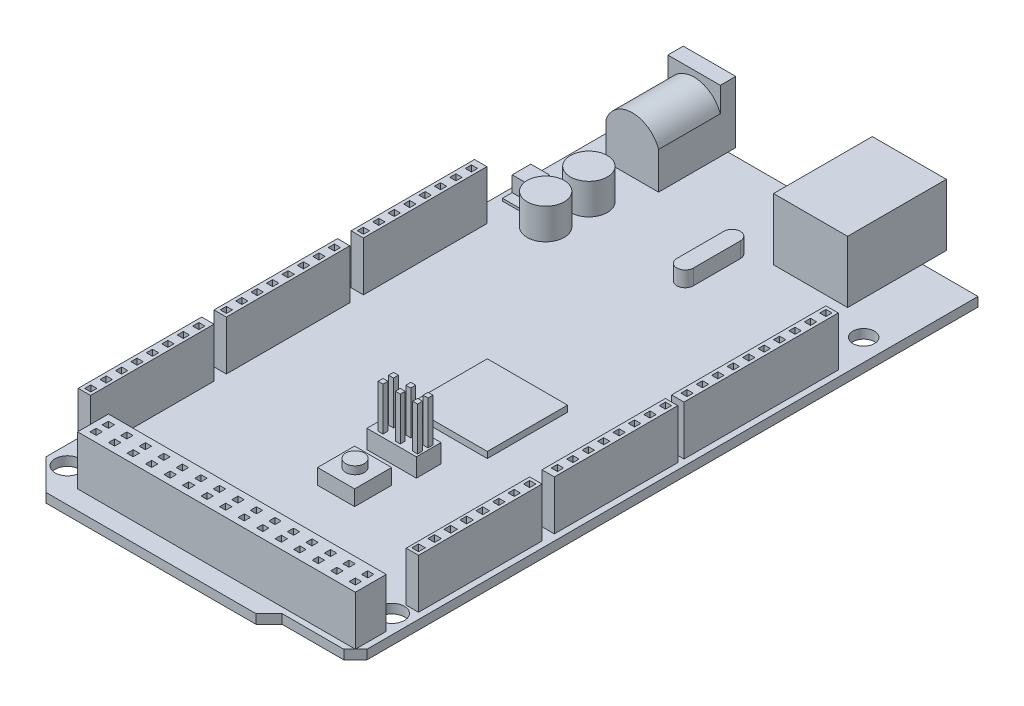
from build123d import *

# Parameters (mm, degrees)
BOSS_EXTRUDE3_DEPTH  = 1.5
SKETCH4_W            = 45
SKETCH4_H            = 5
BOSS_EXTRUDE5_DEPTH  = 8
SKETCH7_W            = 1
SKETCH7_H            = 1
CUT_EXTRUDE1_DEPTH   = 8
SKETCH8_W            = 6
SKETCH8_H            = 6
BOSS_EXTRUDE7_DEPTH  = 2.5
SKETCH10_R           = 1.5
BOSS_EXTRUDE8_DEPTH  = 1.25
SKETCH11_W           = 8
SKETCH11_H           = 4
BOSS_EXTRUDE9_DEPTH  = 3
SKETCH12_W           = 0.8
SKETCH12_H           = 0.8
BOSS_EXTRUDE10_DEPTH = 7
SKETCH13_W           = 13
SKETCH13_H           = 13
BOSS_EXTRUDE11_DEPTH = 1
SKETCH14_W           = 12
SKETCH14_H           = 16
BOSS_EXTRUDE12_DEPTH = 10
CUT_EXTRUDE2_DEPTH   = 13
SKETCH16_W           = 5.556040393
SKETCH16_H           = 3.382310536
BOSS_EXTRUDE13_DEPTH = 13
SKETCH17_W           = 8.5
SKETCH17_H           = 10
BOSS_EXTRUDE14_DEPTH = 1.25
BOSS_EXTRUDE15_DEPTH = 10
SKETCH19_R           = 3
CUT_EXTRUDE6_DEPTH   = 10
SKETCH20_R           = 0.5
BOSS_EXTRUDE16_DEPTH = 8
DOME1_FACE_RADIUS    = 0.5
DOME1_HEIGHT         = 1
SKETCH21_R           = 3
BOSS_EXTRUDE17_DEPTH = 5
SKETCH23_W           = 3.025680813
SKETCH23_H           = 6.185836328
BOSS_EXTRUDE18_DEPTH = 0.4
SKETCH24_W           = 3.025680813
SKETCH24_H           = 3.010787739
BOSS_EXTRUDE19_DEPTH = 2.5
BOSS_EXTRUDE20_DEPTH = 2.5
SKETCH26_R           = 2
CUT_EXTRUDE7_DEPTH   = 1.5
SKETCH27_R           = 2
CUT_EXTRUDE8_DEPTH   = 1.5
SKETCH28_R           = 2
CUT_EXTRUDE9_DEPTH   = 1.5
SKETCH29_W           = 2
SKETCH29_H           = 20
BOSS_EXTRUDE21_DEPTH = 8
SKETCH30_W           = 1
SKETCH30_H           = 1
SKETCH30_W_2         = 1.1
SKETCH30_H_2         = 1.1
CUT_EXTRUDE10_DEPTH  = 8
SKETCH32_W           = 2
SKETCH32_H           = 20
BOSS_EXTRUDE22_DEPTH = 8
SKETCH34_W           = 1
SKETCH34_H           = 1
CUT_EXTRUDE11_DEPTH  = 8
LPATTERN1_COUNT      = 8
LPATTERN1_PITCH      = 2.5
SKETCH37_W           = 2
SKETCH37_H           = 25
BOSS_EXTRUDE24_DEPTH = 8
SKETCH41_W           = 1
SKETCH41_H           = 1
CUT_EXTRUDE13_DEPTH  = 8
LPATTERN3_COUNT      = 10
LPATTERN3_PITCH      = 2.5
SKETCH45_R           = 1.75
CUT_EXTRUDE14_DEPTH  = 1.5
SKETCH46_W           = 2
SKETCH46_H           = 20
BOSS_EXTRUDE25_DEPTH = 8
SKETCH47_W           = 1
SKETCH47_H           = 1
CUT_EXTRUDE15_DEPTH  = 8
LPATTERN4_COUNT      = 8
LPATTERN4_PITCH      = 2.5
SKETCH49_W           = 2
SKETCH49_H           = 20
BOSS_EXTRUDE26_DEPTH = 8
SKETCH50_W           = 1
SKETCH50_H           = 1
CUT_EXTRUDE16_DEPTH  = 8
LPATTERN5_COUNT      = 8
LPATTERN5_PITCH      = 2.5
SKETCH52_W           = 2
SKETCH52_H           = 20
BOSS_EXTRUDE27_DEPTH = 8
SKETCH53_W           = 1
SKETCH53_H           = 1
CUT_EXTRUDE17_DEPTH  = 8
LPATTERN6_COUNT      = 8
LPATTERN6_PITCH      = 2.5


with BuildPart() as part:
    # Sketch1 → Boss-Extrude3 (new body)
    with BuildSketch(Plane(origin=(0, 0, 0), x_dir=(1, 0, 0), z_dir=(0, 1, 0))):
        Polygon((0, 0), (34, 0), (36.121320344, 2.121320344), (46.121320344, 2.121320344), (48, 4), (48, 103), (-5, 103), (-5, 5), align=None)
    extrude(amount=BOSS_EXTRUDE3_DEPTH)

    # Sketch4 → Boss-Extrude5 (add)
    with BuildSketch(Plane(origin=(0, 1.5, 0), x_dir=(1, 0, 0), z_dir=(0, 1, 0))):
        with Locations((24.560660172, 5.560660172)):
            Rectangle(SKETCH4_W, SKETCH4_H)
    extrude(amount=BOSS_EXTRUDE5_DEPTH)

    # Sketch7 → Cut-Extrude1 (cut)
    with BuildSketch(Plane(origin=(0, 9.5, 0), x_dir=(1, 0, 0), z_dir=(0, 1, 0))):
        with Locations((45.560660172, 6.560660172)):
            Rectangle(SKETCH7_W, SKETCH7_H)
        with Locations((45.560660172, 4.560660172)):
            Rectangle(SKETCH7_W, SKETCH7_H)
        with Locations((42.560660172, 4.560660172)):
            Rectangle(SKETCH7_W, SKETCH7_H)
        with Locations((42.560660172, 6.540676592)):
            Rectangle(SKETCH7_W, SKETCH7_H)
        with Locations((39.560660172, 6.540676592)):
            Rectangle(SKETCH7_W, SKETCH7_H)
        with Locations((39.560660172, 4.560660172)):
            Rectangle(SKETCH7_W, SKETCH7_H)
        with Locations((36.560660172, 4.560660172)):
            Rectangle(SKETCH7_W, SKETCH7_H)
        with Locations((36.560660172, 6.540676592)):
            Rectangle(SKETCH7_W, SKETCH7_H)
        with Locations((33.560660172, 6.540676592)):
            Rectangle(SKETCH7_W, SKETCH7_H)
        with Locations((33.560660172, 4.560660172)):
            Rectangle(SKETCH7_W, SKETCH7_H)
        with Locations((30.560660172, 4.560660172)):
            Rectangle(SKETCH7_W, SKETCH7_H)
        with Locations((30.560660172, 6.540676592)):
            Rectangle(SKETCH7_W, SKETCH7_H)
        with Locations((27.560660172, 6.540676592)):
            Rectangle(SKETCH7_W, SKETCH7_H)
        with Locations((27.560660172, 4.560660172)):
            Rectangle(SKETCH7_W, SKETCH7_H)
        with Locations((24.560660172, 6.540676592)):
            Rectangle(SKETCH7_W, SKETCH7_H)
        with Locations((21.560660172, 6.540676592)):
            Rectangle(SKETCH7_W, SKETCH7_H)
        with Locations((24.560660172, 4.560660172)):
            Rectangle(SKETCH7_W, SKETCH7_H)
        with Locations((18.560660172, 6.540676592)):
            Rectangle(SKETCH7_W, SKETCH7_H)
        with Locations((15.560660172, 6.540676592)):
            Rectangle(SKETCH7_W, SKETCH7_H)
        with Locations((21.560660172, 4.560660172)):
            Rectangle(SKETCH7_W, SKETCH7_H)
        with Locations((18.560660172, 4.560660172)):
            Rectangle(SKETCH7_W, SKETCH7_H)
        with Locations((12.560660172, 6.540676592)):
            Rectangle(SKETCH7_W, SKETCH7_H)
        with Locations((9.560660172, 6.540676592)):
            Rectangle(SKETCH7_W, SKETCH7_H)
        with Locations((15.560660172, 4.560660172)):
            Rectangle(SKETCH7_W, SKETCH7_H)
        with Locations((6.560660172, 6.540676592)):
            Rectangle(SKETCH7_W, SKETCH7_H)
        with Locations((3.560660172, 6.540676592)):
            Rectangle(SKETCH7_W, SKETCH7_H)
        with Locations((12.560660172, 4.560660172)):
            Rectangle(SKETCH7_W, SKETCH7_H)
        with Locations((9.560660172, 4.560660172)):
            Rectangle(SKETCH7_W, SKETCH7_H)
        with Locations((6.560660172, 4.560660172)):
            Rectangle(SKETCH7_W, SKETCH7_H)
        with Locations((3.560660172, 4.560660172)):
            Rectangle(SKETCH7_W, SKETCH7_H)
    extrude(amount=-CUT_EXTRUDE1_DEPTH, mode=Mode.SUBTRACT)

    # Sketch8 → Boss-Extrude7 (add)
    with BuildSketch(Plane(origin=(0, 1.5, 0), x_dir=(1, 0, 0), z_dir=(0, 1, 0))):
        with Locations((24, 26)):
            Rectangle(SKETCH8_W, SKETCH8_H)
    extrude(amount=BOSS_EXTRUDE7_DEPTH)

    # Sketch10 → Boss-Extrude8 (add)
    with BuildSketch(Plane(origin=(0, 4, 0), x_dir=(1, 0, 0), z_dir=(0, 1, 0))):
        with Locations(Location((24, 26.073311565, 0), (0, 0, 270))):
            Circle(SKETCH10_R)
    extrude(amount=BOSS_EXTRUDE8_DEPTH)

    # Sketch11 → Boss-Extrude9 (add)
    with BuildSketch(Plane(origin=(0, 1.5, 0), x_dir=(1, 0, 0), z_dir=(0, 1, 0))):
        with Locations((24, 34)):
            Rectangle(SKETCH11_W, SKETCH11_H)
    extrude(amount=BOSS_EXTRUDE9_DEPTH)

    # Sketch12 → Boss-Extrude10 (add)
    with BuildSketch(Plane(origin=(0, 4.5, 0), x_dir=(1, 0, 0), z_dir=(0, 1, 0))):
        with Locations((27.3, 34.6)):
            Rectangle(SKETCH12_W, SKETCH12_H)
        with Locations((24.5, 34.6)):
            Rectangle(SKETCH12_W, SKETCH12_H)
        with Locations((21.7, 34.6)):
            Rectangle(SKETCH12_W, SKETCH12_H)
        with Locations((21.7, 32.9)):
            Rectangle(SKETCH12_W, SKETCH12_H)
        with Locations((24.5, 32.9)):
            Rectangle(SKETCH12_W, SKETCH12_H)
        with Locations((27.3, 32.9)):
            Rectangle(SKETCH12_W, SKETCH12_H)
    extrude(amount=BOSS_EXTRUDE10_DEPTH)

    # Sketch13 → Boss-Extrude11 (add)
    with BuildSketch(Plane(origin=(0, 1.5, 0), x_dir=(1, 0, 0), z_dir=(0, 1, 0))):
        with Locations((24.5, 47)):
            Rectangle(SKETCH13_W, SKETCH13_H)
    extrude(amount=BOSS_EXTRUDE11_DEPTH)

    # Sketch14 → Boss-Extrude12 (add)
    with BuildSketch(Plane(origin=(0, 1.5, 0), x_dir=(1, 0, 0), z_dir=(0, 1, 0))):
        with Locations((33, 98.872790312)):
            Rectangle(SKETCH14_W, SKETCH14_H)
    extrude(amount=BOSS_EXTRUDE12_DEPTH)

    # Sketch15 → Cut-Extrude2 (cut)
    with BuildSketch(Plane(origin=(0, 0, -106.872790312), x_dir=(-1, 0, 0), z_dir=(0, 0, -1))):
        Polygon((-37.504201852, 2.874498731), (-37.504201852, 7.776667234), (-35.780869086, 9.5), (-30.271494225, 9.5), (-28.548161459, 7.776667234), (-28.548161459, 2.874498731), align=None)
    extrude(amount=-CUT_EXTRUDE2_DEPTH, mode=Mode.SUBTRACT)

    # Sketch16 → Boss-Extrude13 (add)
    with BuildSketch(Plane(origin=(0, 0, -93.872790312), x_dir=(-1, 0, 0), z_dir=(0, 0, -1))):
        with Locations((-33.026181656, 6.088795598)):
            Rectangle(SKETCH16_W, SKETCH16_H)
    extrude(amount=BOSS_EXTRUDE13_DEPTH)

    # Sketch17 → Boss-Extrude14 (add, symmetric)
    with BuildSketch(Plane(origin=(0, 0, -103), x_dir=(-1, 0, 0), z_dir=(0, 0, -1))):
        with Locations((-3.25, 6.5)):
            Rectangle(SKETCH17_W, SKETCH17_H)
    extrude(amount=BOSS_EXTRUDE14_DEPTH, both=True)

    # Sketch18 → Boss-Extrude15 (add)
    with BuildSketch(Plane.XY.offset(-101.75)):
        with BuildLine():
            Line((-1, 7.5), (-1, 1.5))
            Line((-1, 1.5), (7.5, 1.5))
            Line((7.5, 1.5), (7.5, 7.5))
            ThreePointArc((7.5, 7.5), (3.25, 10.520980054), (-1, 7.5))
        make_face()
    extrude(amount=BOSS_EXTRUDE15_DEPTH)

    # Sketch19 → Cut-Extrude6 (cut)
    with BuildSketch(Plane(origin=(0, 0, -104.25), x_dir=(-1, 0, 0), z_dir=(0, 0, -1))):
        with Locations((-3, 6.5)):
            Circle(SKETCH19_R)
    extrude(amount=-CUT_EXTRUDE6_DEPTH, mode=Mode.SUBTRACT)

    # Sketch20 → Boss-Extrude16 (add)
    with BuildSketch(Plane(origin=(0, 0, -94.25), x_dir=(-1, 0, 0), z_dir=(0, 0, -1))):
        with Locations((-3, 6.5)):
            Circle(SKETCH20_R)
    extrude(amount=BOSS_EXTRUDE16_DEPTH)

    # Dome1: a dome of height H over a round flat face of radius A is a cap of a sphere of radius (A * A + H * H) / (2 * H)
    dome1_r = (DOME1_FACE_RADIUS * DOME1_FACE_RADIUS + DOME1_HEIGHT * DOME1_HEIGHT) / (2 * DOME1_HEIGHT)
    dome1_base = Plane((3, 6.5, -102.25), z_dir=(0, 0, -1))
    with Locations(dome1_base.offset(DOME1_HEIGHT - dome1_r)):
        dome1_ball = Sphere(dome1_r, mode=Mode.PRIVATE)
    add(split(dome1_ball, bisect_by=dome1_base, keep=Keep.TOP, mode=Mode.PRIVATE))

    # Sketch21 → Boss-Extrude17 (add)
    with BuildSketch(Plane(origin=(0, 1.5, 0), x_dir=(1, 0, 0), z_dir=(0, 1, 0))):
        with Locations(Location((3.204807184, 84.75, 0), (0, 0, 270))):
            Circle(SKETCH21_R)
        with Locations(Location((3.204807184, 77.75, 0), (0, 0, 270))):
            Circle(SKETCH21_R)
    extrude(amount=BOSS_EXTRUDE17_DEPTH)

    # Sketch23 → Boss-Extrude18 (add)
    with BuildSketch(Plane(origin=(0, 1.5, 0), x_dir=(1, 0, 0), z_dir=(0, 1, 0))):
        with Locations((-2.384923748, 80.942657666)):
            Rectangle(SKETCH23_W, SKETCH23_H)
    extrude(amount=BOSS_EXTRUDE18_DEPTH)

    # Sketch24 → Boss-Extrude19 (add)
    with BuildSketch(Plane(origin=(0, 1.9, 0), x_dir=(1, 0, 0), z_dir=(0, 1, 0))):
        with Locations((-2.384923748, 80.930065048)):
            Rectangle(SKETCH24_W, SKETCH24_H)
    extrude(amount=BOSS_EXTRUDE19_DEPTH)

    # Sketch25 → Boss-Extrude20 (add)
    with BuildSketch(Plane(origin=(0, 1.5, 0), x_dir=(1, 0, 0), z_dir=(0, 1, 0))):
        with BuildLine():
            Line((20.771758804, 89.050138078), (20.771758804, 81.430202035))
            ThreePointArc((20.771758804, 81.430202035), (22.112303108, 80.089657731), (23.452847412, 81.430202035))
            Line((23.452847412, 81.430202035), (23.452847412, 89.050138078))
            ThreePointArc((23.452847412, 89.050138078), (22.112303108, 90.390682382), (20.771758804, 89.050138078))
        make_face()
    extrude(amount=BOSS_EXTRUDE20_DEPTH)

    # Sketch26 → Cut-Extrude7 (cut)
    with BuildSketch(Plane(origin=(0, 1.5, 0), x_dir=(1, 0, 0), z_dir=(0, 1, 0))):
        with Locations(Location((-2, 89, 0), (0, 0, 270))):
            Circle(SKETCH26_R)
    extrude(amount=-CUT_EXTRUDE7_DEPTH, mode=Mode.SUBTRACT)

    # Sketch27 → Cut-Extrude8 (cut)
    with BuildSketch(Plane(origin=(0, 1.5, 0), x_dir=(1, 0, 0), z_dir=(0, 1, 0))):
        with Locations(Location((-2, 5.472916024, 0), (0, 0, 270))):
            Circle(SKETCH27_R)
    extrude(amount=-CUT_EXTRUDE8_DEPTH, mode=Mode.SUBTRACT)

    # Sketch28 → Cut-Extrude9 (cut)
    with BuildSketch(Plane(origin=(0, 1.5, 0), x_dir=(1, 0, 0), z_dir=(0, 1, 0))):
        with Locations(Location((45, 11.060660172, 0), (0, 0, 270))):
            Circle(SKETCH28_R)
    extrude(amount=-CUT_EXTRUDE9_DEPTH, mode=Mode.SUBTRACT)

    # Sketch29 → Boss-Extrude21 (add)
    with BuildSketch(Plane(origin=(0, 1.5, 0), x_dir=(1, 0, 0), z_dir=(0, 1, 0))):
        with Locations((46, 23.360660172)):
            Rectangle(SKETCH29_W, SKETCH29_H)
    extrude(amount=BOSS_EXTRUDE21_DEPTH)

    # Sketch30 → Cut-Extrude10 (cut)
    with BuildSketch(Plane(origin=(0, 9.5, 0), x_dir=(1, 0, 0), z_dir=(0, 1, 0))):
        with Locations((46, 32.360660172)):
            Rectangle(SKETCH30_W, SKETCH30_H)
        with Locations((46, 29.860660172)):
            Rectangle(SKETCH30_W, SKETCH30_H)
        with Locations((46, 27.360660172)):
            Rectangle(SKETCH30_W, SKETCH30_H)
        with Locations((45.95, 24.810660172)):
            Rectangle(SKETCH30_W_2, SKETCH30_H_2)
        with Locations((45.95, 22.210660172)):
            Rectangle(SKETCH30_W_2, SKETCH30_H_2)
        with Locations((45.95, 19.610660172)):
            Rectangle(SKETCH30_W_2, SKETCH30_H_2)
        with Locations((45.95, 17.010660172)):
            Rectangle(SKETCH30_W_2, SKETCH30_H_2)
        with Locations((45.95, 14.410660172)):
            Rectangle(SKETCH30_W_2, SKETCH30_H_2)
    extrude(amount=-CUT_EXTRUDE10_DEPTH, mode=Mode.SUBTRACT)

    # Sketch32 → Boss-Extrude22 (add)
    with BuildSketch(Plane(origin=(0, 1.5, 0), x_dir=(1, 0, 0), z_dir=(0, 1, 0))):
        with Locations((46, 45.360660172)):
            Rectangle(SKETCH32_W, SKETCH32_H)
    extrude(amount=BOSS_EXTRUDE22_DEPTH)

    # Sketch34 → Cut-Extrude11 (cut)
    with BuildSketch(Plane(origin=(0, 9.5, 0), x_dir=(1, 0, 0), z_dir=(0, 1, 0))):
        with Locations((46, 54.360660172)):
            Rectangle(SKETCH34_W, SKETCH34_H)
    cut_extrude11 = extrude(amount=-CUT_EXTRUDE11_DEPTH, mode=Mode.SUBTRACT)

    # LPattern1: Cut-Extrude11 ×8
    with Locations(*[(0, 0, i * LPATTERN1_PITCH) for i in range(1, LPATTERN1_COUNT)]):
        add(cut_extrude11, mode=Mode.SUBTRACT)

    # Sketch37 → Boss-Extrude24 (add)
    with BuildSketch(Plane(origin=(0, 1.5, 0), x_dir=(1, 0, 0), z_dir=(0, 1, 0))):
        with Locations((46, 68.860660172)):
            Rectangle(SKETCH37_W, SKETCH37_H)
    extrude(amount=BOSS_EXTRUDE24_DEPTH)

    # Sketch41 → Cut-Extrude13 (cut)
    with BuildSketch(Plane(origin=(0, 9.5, 0), x_dir=(1, 0, 0), z_dir=(0, 1, 0))):
        with Locations((46, 80.360660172)):
            Rectangle(SKETCH41_W, SKETCH41_H)
    cut_extrude13 = extrude(amount=-CUT_EXTRUDE13_DEPTH, mode=Mode.SUBTRACT)

    # LPattern3: Cut-Extrude13 ×10
    with Locations(*[(0, 0, i * LPATTERN3_PITCH) for i in range(1, LPATTERN3_COUNT)]):
        add(cut_extrude13, mode=Mode.SUBTRACT)

    # Sketch45 → Cut-Extrude14 (cut)
    with BuildSketch(Plane(origin=(0, 1.5, 0), x_dir=(1, 0, 0), z_dir=(0, 1, 0))):
        with Locations(Location((44.475, 88, 0), (0, 0, 270))):
            Circle(SKETCH45_R)
    extrude(amount=-CUT_EXTRUDE14_DEPTH, mode=Mode.SUBTRACT)

    # Sketch46 → Boss-Extrude25 (add)
    with BuildSketch(Plane(origin=(0, 1.5, 0), x_dir=(1, 0, 0), z_dir=(0, 1, 0))):
        with Locations((-3, 19.222916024)):
            Rectangle(SKETCH46_W, SKETCH46_H)
    extrude(amount=BOSS_EXTRUDE25_DEPTH)

    # Sketch47 → Cut-Extrude15 (cut)
    with BuildSketch(Plane(origin=(0, 9.5, 0), x_dir=(1, 0, 0), z_dir=(0, 1, 0))):
        with Locations((-2.966482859, 10.222916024)):
            Rectangle(SKETCH47_W, SKETCH47_H)
    cut_extrude15 = extrude(amount=-CUT_EXTRUDE15_DEPTH, mode=Mode.SUBTRACT)

    # LPattern4: Cut-Extrude15 ×8
    with Locations(*[(0, 0, -i * LPATTERN4_PITCH) for i in range(1, LPATTERN4_COUNT)]):
        add(cut_extrude15, mode=Mode.SUBTRACT)

    # Sketch49 → Boss-Extrude26 (add)
    with BuildSketch(Plane(origin=(0, 1.5, 0), x_dir=(1, 0, 0), z_dir=(0, 1, 0))):
        with Locations((-3, 41.222916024)):
            Rectangle(SKETCH49_W, SKETCH49_H)
    extrude(amount=BOSS_EXTRUDE26_DEPTH)

    # Sketch50 → Cut-Extrude16 (cut)
    with BuildSketch(Plane(origin=(0, 9.5, 0), x_dir=(1, 0, 0), z_dir=(0, 1, 0))):
        with Locations((-3, 32.222916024)):
            Rectangle(SKETCH50_W, SKETCH50_H)
    cut_extrude16 = extrude(amount=-CUT_EXTRUDE16_DEPTH, mode=Mode.SUBTRACT)

    # LPattern5: Cut-Extrude16 ×8
    with Locations(*[(0, 0, -i * LPATTERN5_PITCH) for i in range(1, LPATTERN5_COUNT)]):
        add(cut_extrude16, mode=Mode.SUBTRACT)

    # Sketch52 → Boss-Extrude27 (add)
    with BuildSketch(Plane(origin=(0, 1.5, 0), x_dir=(1, 0, 0), z_dir=(0, 1, 0))):
        with Locations((-3, 63.427355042)):
            Rectangle(SKETCH52_W, SKETCH52_H)
    extrude(amount=BOSS_EXTRUDE27_DEPTH)

    # Sketch53 → Cut-Extrude17 (cut)
    with BuildSketch(Plane(origin=(0, 9.5, 0), x_dir=(1, 0, 0), z_dir=(0, 1, 0))):
        with Locations((-3, 54.427355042)):
            Rectangle(SKETCH53_W, SKETCH53_H)
    cut_extrude17 = extrude(amount=-CUT_EXTRUDE17_DEPTH, mode=Mode.SUBTRACT)

    # LPattern6: Cut-Extrude17 ×8
    with Locations(*[(0, 0, -i * LPATTERN6_PITCH) for i in range(1, LPATTERN6_COUNT)]):
        add(cut_extrude17, mode=Mode.SUBTRACT)


solid = part.part
